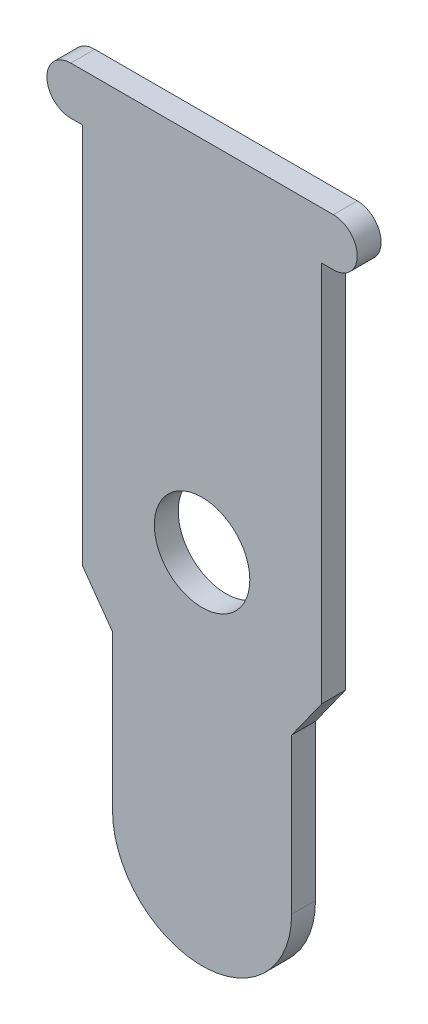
ISO-10303-21;
HEADER;
FILE_DESCRIPTION(('STEP AP214'),'2;1');
FILE_NAME('part.step','',(''),(''),'','','');
FILE_SCHEMA(('AUTOMOTIVE_DESIGN { 1 0 10303 214 1 1 1 1 }'));
ENDSEC;
DATA;
#1=APPLICATION_CONTEXT('core data for automotive mechanical design processes');
#2=APPLICATION_PROTOCOL_DEFINITION('international standard','automotive_design',2000,#1);
#3=PRODUCT_CONTEXT('',#1,'mechanical');
#4=PRODUCT('Part','Part','',(#3));
#5=PRODUCT_RELATED_PRODUCT_CATEGORY('part','',(#4));
#6=PRODUCT_DEFINITION_FORMATION('','',#4);
#7=PRODUCT_DEFINITION_CONTEXT('part definition',#1,'design');
#8=PRODUCT_DEFINITION('design','',#6,#7);
#9=PRODUCT_DEFINITION_SHAPE('','',#8);
#10=(LENGTH_UNIT() NAMED_UNIT(*) SI_UNIT(.MILLI.,.METRE.));
#11=(NAMED_UNIT(*) PLANE_ANGLE_UNIT() SI_UNIT($,.RADIAN.));
#12=(NAMED_UNIT(*) SI_UNIT($,.STERADIAN.) SOLID_ANGLE_UNIT());
#13=UNCERTAINTY_MEASURE_WITH_UNIT(LENGTH_MEASURE(1.E-05),#10,'distance_accuracy_value','');
#14=(GEOMETRIC_REPRESENTATION_CONTEXT(3) GLOBAL_UNCERTAINTY_ASSIGNED_CONTEXT((#13)) GLOBAL_UNIT_ASSIGNED_CONTEXT((#10,
#11,#12)) REPRESENTATION_CONTEXT('',''));
#15=CARTESIAN_POINT('',(0.,0.,0.));
#16=DIRECTION('',(0.,0.,1.));
#17=DIRECTION('',(1.,0.,0.));
#18=AXIS2_PLACEMENT_3D('',#15,#16,#17);
#19=CARTESIAN_POINT('',(11.,28.,2.));
#20=DIRECTION('',(0.,0.,-1.));
#21=DIRECTION('',(-1.,0.,0.));
#22=AXIS2_PLACEMENT_3D('',#19,#20,#21);
#23=PLANE('',#22);
#24=CARTESIAN_POINT('',(11.,28.,2.));
#25=DIRECTION('',(0.,0.,1.));
#26=DIRECTION('',(-1.,0.,0.));
#27=AXIS2_PLACEMENT_3D('',#24,#25,#26);
#28=CIRCLE('',#27,2.);
#29=CARTESIAN_POINT('',(11.,26.,2.));
#30=VERTEX_POINT('',#29);
#31=CARTESIAN_POINT('',(11.,30.,2.));
#32=VERTEX_POINT('',#31);
#33=EDGE_CURVE('E175',#30,#32,#28,.T.);
#34=ORIENTED_EDGE('',*,*,#33,.T.);
#35=DIRECTION('',(-1.,0.,0.));
#36=VECTOR('',#35,1.);
#37=CARTESIAN_POINT('',(-11.,30.,2.));
#38=LINE('',#37,#36);
#39=CARTESIAN_POINT('',(-11.,30.,2.));
#40=VERTEX_POINT('',#39);
#41=EDGE_CURVE('E103',#32,#40,#38,.T.);
#42=ORIENTED_EDGE('',*,*,#41,.T.);
#43=CARTESIAN_POINT('',(-11.,28.,2.));
#44=DIRECTION('',(0.,0.,1.));
#45=DIRECTION('',(1.,0.,0.));
#46=AXIS2_PLACEMENT_3D('',#43,#44,#45);
#47=CIRCLE('',#46,2.);
#48=CARTESIAN_POINT('',(-11.,26.,2.));
#49=VERTEX_POINT('',#48);
#50=EDGE_CURVE('E202',#40,#49,#47,.T.);
#51=ORIENTED_EDGE('',*,*,#50,.T.);
#52=DIRECTION('',(1.,0.,0.));
#53=VECTOR('',#52,1.);
#54=CARTESIAN_POINT('',(-11.,26.,2.));
#55=LINE('',#54,#53);
#56=CARTESIAN_POINT('',(-10.,26.,2.));
#57=VERTEX_POINT('',#56);
#58=EDGE_CURVE('E221',#49,#57,#55,.T.);
#59=ORIENTED_EDGE('',*,*,#58,.T.);
#60=DIRECTION('',(0.,-1.,0.));
#61=VECTOR('',#60,1.);
#62=CARTESIAN_POINT('',(-10.,26.,2.));
#63=LINE('',#62,#61);
#64=CARTESIAN_POINT('',(-10.,-6.00000000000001,2.));
#65=VERTEX_POINT('',#64);
#66=EDGE_CURVE('E218',#57,#65,#63,.T.);
#67=ORIENTED_EDGE('',*,*,#66,.T.);
#68=DIRECTION('',(0.581238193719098,-0.813733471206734,0.));
#69=VECTOR('',#68,1.);
#70=CARTESIAN_POINT('',(-10.,-6.00000000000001,2.));
#71=LINE('',#70,#69);
#72=CARTESIAN_POINT('',(-7.49999999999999,-9.5,2.));
#73=VERTEX_POINT('',#72);
#74=EDGE_CURVE('E220',#65,#73,#71,.T.);
#75=ORIENTED_EDGE('',*,*,#74,.T.);
#76=DIRECTION('',(0.,-1.,0.));
#77=VECTOR('',#76,1.);
#78=CARTESIAN_POINT('',(-7.49999999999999,-9.5,2.));
#79=LINE('',#78,#77);
#80=CARTESIAN_POINT('',(-7.49999999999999,-22.5,2.));
#81=VERTEX_POINT('',#80);
#82=EDGE_CURVE('E223',#73,#81,#79,.T.);
#83=ORIENTED_EDGE('',*,*,#82,.T.);
#84=CARTESIAN_POINT('',(0.,-22.5,2.));
#85=DIRECTION('',(0.,0.,1.));
#86=DIRECTION('',(-1.,0.,0.));
#87=AXIS2_PLACEMENT_3D('',#84,#85,#86);
#88=CIRCLE('',#87,7.5);
#89=CARTESIAN_POINT('',(7.50000000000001,-22.5,2.));
#90=VERTEX_POINT('',#89);
#91=EDGE_CURVE('E229',#81,#90,#88,.T.);
#92=ORIENTED_EDGE('',*,*,#91,.T.);
#93=DIRECTION('',(0.,1.,0.));
#94=VECTOR('',#93,1.);
#95=CARTESIAN_POINT('',(7.5,-9.5,2.));
#96=LINE('',#95,#94);
#97=CARTESIAN_POINT('',(7.5,-9.5,2.));
#98=VERTEX_POINT('',#97);
#99=EDGE_CURVE('E134',#90,#98,#96,.T.);
#100=ORIENTED_EDGE('',*,*,#99,.T.);
#101=DIRECTION('',(0.581238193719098,0.813733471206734,0.));
#102=VECTOR('',#101,1.);
#103=CARTESIAN_POINT('',(10.,-6.00000000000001,2.));
#104=LINE('',#103,#102);
#105=CARTESIAN_POINT('',(10.,-6.00000000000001,2.));
#106=VERTEX_POINT('',#105);
#107=EDGE_CURVE('E128',#98,#106,#104,.T.);
#108=ORIENTED_EDGE('',*,*,#107,.T.);
#109=DIRECTION('',(0.,1.,0.));
#110=VECTOR('',#109,1.);
#111=CARTESIAN_POINT('',(10.,26.,2.));
#112=LINE('',#111,#110);
#113=CARTESIAN_POINT('',(10.,26.,2.));
#114=VERTEX_POINT('',#113);
#115=EDGE_CURVE('E132',#106,#114,#112,.T.);
#116=ORIENTED_EDGE('',*,*,#115,.T.);
#117=DIRECTION('',(1.,0.,0.));
#118=VECTOR('',#117,1.);
#119=CARTESIAN_POINT('',(11.,26.,2.));
#120=LINE('',#119,#118);
#121=EDGE_CURVE('E48',#114,#30,#120,.T.);
#122=ORIENTED_EDGE('',*,*,#121,.T.);
#123=EDGE_LOOP('',(#34,#42,#51,#59,#67,#75,#83,#92,#100,#108,#116,#122));
#124=FACE_BOUND('',#123,.T.);
#125=CARTESIAN_POINT('',(0.,0.,2.));
#126=DIRECTION('',(0.,0.,1.));
#127=DIRECTION('',(1.,0.,0.));
#128=AXIS2_PLACEMENT_3D('',#125,#126,#127);
#129=CIRCLE('',#128,4.);
#130=CARTESIAN_POINT('',(4.,0.,2.));
#131=VERTEX_POINT('',#130);
#132=EDGE_CURVE('E156',#131,#131,#129,.T.);
#133=ORIENTED_EDGE('',*,*,#132,.F.);
#134=EDGE_LOOP('',(#133));
#135=FACE_BOUND('',#134,.T.);
#136=ADVANCED_FACE('F31',(#124,#135),#23,.F.);
#137=CARTESIAN_POINT('',(11.,28.,0.));
#138=DIRECTION('',(0.,0.,-1.));
#139=DIRECTION('',(-1.,0.,0.));
#140=AXIS2_PLACEMENT_3D('',#137,#138,#139);
#141=PLANE('',#140);
#142=CARTESIAN_POINT('',(11.,28.,0.));
#143=DIRECTION('',(0.,0.,1.));
#144=DIRECTION('',(-1.,0.,0.));
#145=AXIS2_PLACEMENT_3D('',#142,#143,#144);
#146=CIRCLE('',#145,2.);
#147=CARTESIAN_POINT('',(11.,26.,0.));
#148=VERTEX_POINT('',#147);
#149=CARTESIAN_POINT('',(11.,30.,0.));
#150=VERTEX_POINT('',#149);
#151=EDGE_CURVE('E152',#148,#150,#146,.T.);
#152=ORIENTED_EDGE('',*,*,#151,.F.);
#153=DIRECTION('',(1.,0.,0.));
#154=VECTOR('',#153,1.);
#155=CARTESIAN_POINT('',(11.,26.,0.));
#156=LINE('',#155,#154);
#157=CARTESIAN_POINT('',(10.,26.,0.));
#158=VERTEX_POINT('',#157);
#159=EDGE_CURVE('E95',#158,#148,#156,.T.);
#160=ORIENTED_EDGE('',*,*,#159,.F.);
#161=DIRECTION('',(0.,1.,0.));
#162=VECTOR('',#161,1.);
#163=CARTESIAN_POINT('',(10.,26.,0.));
#164=LINE('',#163,#162);
#165=CARTESIAN_POINT('',(10.,-6.00000000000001,0.));
#166=VERTEX_POINT('',#165);
#167=EDGE_CURVE('E89',#166,#158,#164,.T.);
#168=ORIENTED_EDGE('',*,*,#167,.F.);
#169=DIRECTION('',(0.581238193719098,0.813733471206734,0.));
#170=VECTOR('',#169,1.);
#171=CARTESIAN_POINT('',(10.,-6.00000000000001,0.));
#172=LINE('',#171,#170);
#173=CARTESIAN_POINT('',(7.5,-9.5,0.));
#174=VERTEX_POINT('',#173);
#175=EDGE_CURVE('E142',#174,#166,#172,.T.);
#176=ORIENTED_EDGE('',*,*,#175,.F.);
#177=DIRECTION('',(0.,1.,0.));
#178=VECTOR('',#177,1.);
#179=CARTESIAN_POINT('',(7.5,-9.5,0.));
#180=LINE('',#179,#178);
#181=CARTESIAN_POINT('',(7.50000000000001,-22.5,0.));
#182=VERTEX_POINT('',#181);
#183=EDGE_CURVE('E170',#182,#174,#180,.T.);
#184=ORIENTED_EDGE('',*,*,#183,.F.);
#185=CARTESIAN_POINT('',(0.,-22.5,0.));
#186=DIRECTION('',(0.,0.,1.));
#187=DIRECTION('',(-1.,0.,0.));
#188=AXIS2_PLACEMENT_3D('',#185,#186,#187);
#189=CIRCLE('',#188,7.5);
#190=CARTESIAN_POINT('',(-7.49999999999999,-22.5,0.));
#191=VERTEX_POINT('',#190);
#192=EDGE_CURVE('E168',#191,#182,#189,.T.);
#193=ORIENTED_EDGE('',*,*,#192,.F.);
#194=DIRECTION('',(0.,-1.,0.));
#195=VECTOR('',#194,1.);
#196=CARTESIAN_POINT('',(-7.49999999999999,-9.5,0.));
#197=LINE('',#196,#195);
#198=CARTESIAN_POINT('',(-7.49999999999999,-9.5,0.));
#199=VERTEX_POINT('',#198);
#200=EDGE_CURVE('E166',#199,#191,#197,.T.);
#201=ORIENTED_EDGE('',*,*,#200,.F.);
#202=DIRECTION('',(0.581238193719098,-0.813733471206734,0.));
#203=VECTOR('',#202,1.);
#204=CARTESIAN_POINT('',(-10.,-6.00000000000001,0.));
#205=LINE('',#204,#203);
#206=CARTESIAN_POINT('',(-10.,-6.00000000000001,0.));
#207=VERTEX_POINT('',#206);
#208=EDGE_CURVE('E164',#207,#199,#205,.T.);
#209=ORIENTED_EDGE('',*,*,#208,.F.);
#210=DIRECTION('',(0.,-1.,0.));
#211=VECTOR('',#210,1.);
#212=CARTESIAN_POINT('',(-10.,26.,0.));
#213=LINE('',#212,#211);
#214=CARTESIAN_POINT('',(-10.,26.,0.));
#215=VERTEX_POINT('',#214);
#216=EDGE_CURVE('E162',#215,#207,#213,.T.);
#217=ORIENTED_EDGE('',*,*,#216,.F.);
#218=DIRECTION('',(1.,0.,0.));
#219=VECTOR('',#218,1.);
#220=CARTESIAN_POINT('',(-11.,26.,0.));
#221=LINE('',#220,#219);
#222=CARTESIAN_POINT('',(-11.,26.,0.));
#223=VERTEX_POINT('',#222);
#224=EDGE_CURVE('E160',#223,#215,#221,.T.);
#225=ORIENTED_EDGE('',*,*,#224,.F.);
#226=CARTESIAN_POINT('',(-11.,28.,0.));
#227=DIRECTION('',(0.,0.,1.));
#228=DIRECTION('',(1.,0.,0.));
#229=AXIS2_PLACEMENT_3D('',#226,#227,#228);
#230=CIRCLE('',#229,2.);
#231=CARTESIAN_POINT('',(-11.,30.,0.));
#232=VERTEX_POINT('',#231);
#233=EDGE_CURVE('E158',#232,#223,#230,.T.);
#234=ORIENTED_EDGE('',*,*,#233,.F.);
#235=DIRECTION('',(-1.,0.,0.));
#236=VECTOR('',#235,1.);
#237=CARTESIAN_POINT('',(-11.,30.,0.));
#238=LINE('',#237,#236);
#239=EDGE_CURVE('E155',#150,#232,#238,.T.);
#240=ORIENTED_EDGE('',*,*,#239,.F.);
#241=EDGE_LOOP('',(#152,#160,#168,#176,#184,#193,#201,#209,#217,#225,#234,#240));
#242=FACE_BOUND('',#241,.T.);
#243=CARTESIAN_POINT('',(0.,0.,0.));
#244=DIRECTION('',(0.,0.,1.));
#245=DIRECTION('',(1.,0.,0.));
#246=AXIS2_PLACEMENT_3D('',#243,#244,#245);
#247=CIRCLE('',#246,4.);
#248=CARTESIAN_POINT('',(4.,0.,0.));
#249=VERTEX_POINT('',#248);
#250=EDGE_CURVE('E376',#249,#249,#247,.T.);
#251=ORIENTED_EDGE('',*,*,#250,.T.);
#252=EDGE_LOOP('',(#251));
#253=FACE_BOUND('',#252,.T.);
#254=ADVANCED_FACE('F206',(#242,#253),#141,.T.);
#255=CARTESIAN_POINT('',(11.,28.,2.));
#256=DIRECTION('',(0.,0.,-1.));
#257=DIRECTION('',(-1.,0.,0.));
#258=AXIS2_PLACEMENT_3D('',#255,#256,#257);
#259=CYLINDRICAL_SURFACE('',#258,2.);
#260=ORIENTED_EDGE('',*,*,#151,.T.);
#261=DIRECTION('',(0.,0.,-1.));
#262=VECTOR('',#261,1.);
#263=CARTESIAN_POINT('',(11.,30.,2.));
#264=LINE('',#263,#262);
#265=EDGE_CURVE('E11',#32,#150,#264,.T.);
#266=ORIENTED_EDGE('',*,*,#265,.F.);
#267=ORIENTED_EDGE('',*,*,#33,.F.);
#268=DIRECTION('',(0.,0.,-1.));
#269=VECTOR('',#268,1.);
#270=CARTESIAN_POINT('',(11.,26.,2.));
#271=LINE('',#270,#269);
#272=EDGE_CURVE('E148',#30,#148,#271,.T.);
#273=ORIENTED_EDGE('',*,*,#272,.T.);
#274=EDGE_LOOP('',(#260,#266,#267,#273));
#275=FACE_BOUND('',#274,.T.);
#276=ADVANCED_FACE('F33',(#275),#259,.T.);
#277=CARTESIAN_POINT('',(-11.,30.,2.));
#278=DIRECTION('',(0.,-1.,0.));
#279=DIRECTION('',(1.,0.,0.));
#280=AXIS2_PLACEMENT_3D('',#277,#278,#279);
#281=PLANE('',#280);
#282=ORIENTED_EDGE('',*,*,#239,.T.);
#283=DIRECTION('',(0.,0.,-1.));
#284=VECTOR('',#283,1.);
#285=CARTESIAN_POINT('',(-11.,30.,2.));
#286=LINE('',#285,#284);
#287=EDGE_CURVE('E40',#40,#232,#286,.T.);
#288=ORIENTED_EDGE('',*,*,#287,.F.);
#289=ORIENTED_EDGE('',*,*,#41,.F.);
#290=ORIENTED_EDGE('',*,*,#265,.T.);
#291=EDGE_LOOP('',(#282,#288,#289,#290));
#292=FACE_BOUND('',#291,.T.);
#293=ADVANCED_FACE('F263',(#292),#281,.F.);
#294=CARTESIAN_POINT('',(-11.,28.,2.));
#295=DIRECTION('',(0.,0.,-1.));
#296=DIRECTION('',(-1.,0.,0.));
#297=AXIS2_PLACEMENT_3D('',#294,#295,#296);
#298=CYLINDRICAL_SURFACE('',#297,2.);
#299=ORIENTED_EDGE('',*,*,#233,.T.);
#300=DIRECTION('',(0.,0.,-1.));
#301=VECTOR('',#300,1.);
#302=CARTESIAN_POINT('',(-11.,26.,2.));
#303=LINE('',#302,#301);
#304=EDGE_CURVE('E194',#49,#223,#303,.T.);
#305=ORIENTED_EDGE('',*,*,#304,.F.);
#306=ORIENTED_EDGE('',*,*,#50,.F.);
#307=ORIENTED_EDGE('',*,*,#287,.T.);
#308=EDGE_LOOP('',(#299,#305,#306,#307));
#309=FACE_BOUND('',#308,.T.);
#310=ADVANCED_FACE('F200',(#309),#298,.T.);
#311=CARTESIAN_POINT('',(-11.,26.,2.));
#312=DIRECTION('',(0.,1.,0.));
#313=DIRECTION('',(-1.,0.,0.));
#314=AXIS2_PLACEMENT_3D('',#311,#312,#313);
#315=PLANE('',#314);
#316=ORIENTED_EDGE('',*,*,#224,.T.);
#317=DIRECTION('',(0.,0.,-1.));
#318=VECTOR('',#317,1.);
#319=CARTESIAN_POINT('',(-10.,26.,2.));
#320=LINE('',#319,#318);
#321=EDGE_CURVE('E191',#57,#215,#320,.T.);
#322=ORIENTED_EDGE('',*,*,#321,.F.);
#323=ORIENTED_EDGE('',*,*,#58,.F.);
#324=ORIENTED_EDGE('',*,*,#304,.T.);
#325=EDGE_LOOP('',(#316,#322,#323,#324));
#326=FACE_BOUND('',#325,.T.);
#327=ADVANCED_FACE('F212',(#326),#315,.F.);
#328=CARTESIAN_POINT('',(-10.,26.,2.));
#329=DIRECTION('',(1.,0.,0.));
#330=DIRECTION('',(0.,1.,0.));
#331=AXIS2_PLACEMENT_3D('',#328,#329,#330);
#332=PLANE('',#331);
#333=ORIENTED_EDGE('',*,*,#216,.T.);
#334=DIRECTION('',(0.,0.,-1.));
#335=VECTOR('',#334,1.);
#336=CARTESIAN_POINT('',(-10.,-6.00000000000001,2.));
#337=LINE('',#336,#335);
#338=EDGE_CURVE('E188',#65,#207,#337,.T.);
#339=ORIENTED_EDGE('',*,*,#338,.F.);
#340=ORIENTED_EDGE('',*,*,#66,.F.);
#341=ORIENTED_EDGE('',*,*,#321,.T.);
#342=EDGE_LOOP('',(#333,#339,#340,#341));
#343=FACE_BOUND('',#342,.T.);
#344=ADVANCED_FACE('F216',(#343),#332,.F.);
#345=CARTESIAN_POINT('',(-10.,-6.00000000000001,2.));
#346=DIRECTION('',(0.813733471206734,0.581238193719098,0.));
#347=DIRECTION('',(-0.581238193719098,0.813733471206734,0.));
#348=AXIS2_PLACEMENT_3D('',#345,#346,#347);
#349=PLANE('',#348);
#350=ORIENTED_EDGE('',*,*,#208,.T.);
#351=DIRECTION('',(0.,0.,-1.));
#352=VECTOR('',#351,1.);
#353=CARTESIAN_POINT('',(-7.49999999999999,-9.5,2.));
#354=LINE('',#353,#352);
#355=EDGE_CURVE('E185',#73,#199,#354,.T.);
#356=ORIENTED_EDGE('',*,*,#355,.F.);
#357=ORIENTED_EDGE('',*,*,#74,.F.);
#358=ORIENTED_EDGE('',*,*,#338,.T.);
#359=EDGE_LOOP('',(#350,#356,#357,#358));
#360=FACE_BOUND('',#359,.T.);
#361=ADVANCED_FACE('F276',(#360),#349,.F.);
#362=CARTESIAN_POINT('',(-7.49999999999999,-9.5,2.));
#363=DIRECTION('',(1.,0.,0.));
#364=DIRECTION('',(0.,1.,0.));
#365=AXIS2_PLACEMENT_3D('',#362,#363,#364);
#366=PLANE('',#365);
#367=ORIENTED_EDGE('',*,*,#200,.T.);
#368=DIRECTION('',(0.,0.,-1.));
#369=VECTOR('',#368,1.);
#370=CARTESIAN_POINT('',(-7.49999999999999,-22.5,2.));
#371=LINE('',#370,#369);
#372=EDGE_CURVE('E182',#81,#191,#371,.T.);
#373=ORIENTED_EDGE('',*,*,#372,.F.);
#374=ORIENTED_EDGE('',*,*,#82,.F.);
#375=ORIENTED_EDGE('',*,*,#355,.T.);
#376=EDGE_LOOP('',(#367,#373,#374,#375));
#377=FACE_BOUND('',#376,.T.);
#378=ADVANCED_FACE('F279',(#377),#366,.F.);
#379=CARTESIAN_POINT('',(0.,-22.5,2.));
#380=DIRECTION('',(0.,0.,-1.));
#381=DIRECTION('',(-1.,0.,0.));
#382=AXIS2_PLACEMENT_3D('',#379,#380,#381);
#383=CYLINDRICAL_SURFACE('',#382,7.5);
#384=ORIENTED_EDGE('',*,*,#192,.T.);
#385=DIRECTION('',(0.,0.,-1.));
#386=VECTOR('',#385,1.);
#387=CARTESIAN_POINT('',(7.50000000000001,-22.5,2.));
#388=LINE('',#387,#386);
#389=EDGE_CURVE('E179',#90,#182,#388,.T.);
#390=ORIENTED_EDGE('',*,*,#389,.F.);
#391=ORIENTED_EDGE('',*,*,#91,.F.);
#392=ORIENTED_EDGE('',*,*,#372,.T.);
#393=EDGE_LOOP('',(#384,#390,#391,#392));
#394=FACE_BOUND('',#393,.T.);
#395=ADVANCED_FACE('F235',(#394),#383,.T.);
#396=CARTESIAN_POINT('',(7.5,-9.5,2.));
#397=DIRECTION('',(-1.,0.,0.));
#398=DIRECTION('',(0.,-1.,0.));
#399=AXIS2_PLACEMENT_3D('',#396,#397,#398);
#400=PLANE('',#399);
#401=ORIENTED_EDGE('',*,*,#183,.T.);
#402=DIRECTION('',(0.,0.,-1.));
#403=VECTOR('',#402,1.);
#404=CARTESIAN_POINT('',(7.5,-9.5,2.));
#405=LINE('',#404,#403);
#406=EDGE_CURVE('E143',#98,#174,#405,.T.);
#407=ORIENTED_EDGE('',*,*,#406,.F.);
#408=ORIENTED_EDGE('',*,*,#99,.F.);
#409=ORIENTED_EDGE('',*,*,#389,.T.);
#410=EDGE_LOOP('',(#401,#407,#408,#409));
#411=FACE_BOUND('',#410,.T.);
#412=ADVANCED_FACE('F239',(#411),#400,.F.);
#413=CARTESIAN_POINT('',(10.,-6.00000000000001,2.));
#414=DIRECTION('',(-0.813733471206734,0.581238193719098,0.));
#415=DIRECTION('',(-0.581238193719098,-0.813733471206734,0.));
#416=AXIS2_PLACEMENT_3D('',#413,#414,#415);
#417=PLANE('',#416);
#418=ORIENTED_EDGE('',*,*,#175,.T.);
#419=DIRECTION('',(0.,0.,-1.));
#420=VECTOR('',#419,1.);
#421=CARTESIAN_POINT('',(10.,-6.00000000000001,2.));
#422=LINE('',#421,#420);
#423=EDGE_CURVE('E139',#106,#166,#422,.T.);
#424=ORIENTED_EDGE('',*,*,#423,.F.);
#425=ORIENTED_EDGE('',*,*,#107,.F.);
#426=ORIENTED_EDGE('',*,*,#406,.T.);
#427=EDGE_LOOP('',(#418,#424,#425,#426));
#428=FACE_BOUND('',#427,.T.);
#429=ADVANCED_FACE('F140',(#428),#417,.F.);
#430=CARTESIAN_POINT('',(10.,26.,2.));
#431=DIRECTION('',(-1.,0.,0.));
#432=DIRECTION('',(0.,-1.,0.));
#433=AXIS2_PLACEMENT_3D('',#430,#431,#432);
#434=PLANE('',#433);
#435=ORIENTED_EDGE('',*,*,#167,.T.);
#436=DIRECTION('',(0.,0.,-1.));
#437=VECTOR('',#436,1.);
#438=CARTESIAN_POINT('',(10.,26.,2.));
#439=LINE('',#438,#437);
#440=EDGE_CURVE('E144',#114,#158,#439,.T.);
#441=ORIENTED_EDGE('',*,*,#440,.F.);
#442=ORIENTED_EDGE('',*,*,#115,.F.);
#443=ORIENTED_EDGE('',*,*,#423,.T.);
#444=EDGE_LOOP('',(#435,#441,#442,#443));
#445=FACE_BOUND('',#444,.T.);
#446=ADVANCED_FACE('F146',(#445),#434,.F.);
#447=CARTESIAN_POINT('',(11.,26.,2.));
#448=DIRECTION('',(0.,1.,0.));
#449=DIRECTION('',(-1.,0.,0.));
#450=AXIS2_PLACEMENT_3D('',#447,#448,#449);
#451=PLANE('',#450);
#452=ORIENTED_EDGE('',*,*,#159,.T.);
#453=ORIENTED_EDGE('',*,*,#272,.F.);
#454=ORIENTED_EDGE('',*,*,#121,.F.);
#455=ORIENTED_EDGE('',*,*,#440,.T.);
#456=EDGE_LOOP('',(#452,#453,#454,#455));
#457=FACE_BOUND('',#456,.T.);
#458=ADVANCED_FACE('F243',(#457),#451,.F.);
#459=CARTESIAN_POINT('',(0.,0.,2.));
#460=DIRECTION('',(0.,0.,-1.));
#461=DIRECTION('',(-1.,0.,0.));
#462=AXIS2_PLACEMENT_3D('',#459,#460,#461);
#463=CYLINDRICAL_SURFACE('',#462,4.);
#464=ORIENTED_EDGE('',*,*,#132,.T.);
#465=EDGE_LOOP('',(#464));
#466=FACE_BOUND('',#465,.T.);
#467=ORIENTED_EDGE('',*,*,#250,.F.);
#468=EDGE_LOOP('',(#467));
#469=FACE_BOUND('',#468,.T.);
#470=ADVANCED_FACE('F245',(#466,#469),#463,.F.);
#471=CLOSED_SHELL('',(#136,#254,#276,#293,#310,#327,#344,#361,#378,#395,#412,#429,#446,#458,#470));
#472=MANIFOLD_SOLID_BREP('B2',#471);
#473=ADVANCED_BREP_SHAPE_REPRESENTATION('',(#18,#472),#14);
#474=SHAPE_DEFINITION_REPRESENTATION(#9,#473);
ENDSEC;
END-ISO-10303-21;
